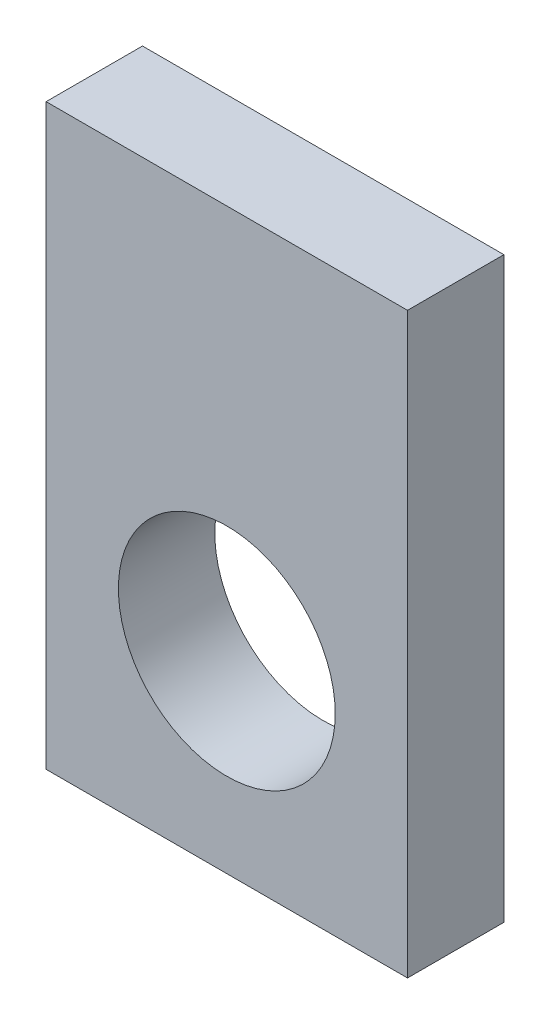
ISO-10303-21;
HEADER;
FILE_DESCRIPTION(('STEP AP214'),'2;1');
FILE_NAME('part.step','',(''),(''),'','','');
FILE_SCHEMA(('AUTOMOTIVE_DESIGN { 1 0 10303 214 1 1 1 1 }'));
ENDSEC;
DATA;
#1=APPLICATION_CONTEXT('core data for automotive mechanical design processes');
#2=APPLICATION_PROTOCOL_DEFINITION('international standard','automotive_design',2000,#1);
#3=PRODUCT_CONTEXT('',#1,'mechanical');
#4=PRODUCT('Part','Part','',(#3));
#5=PRODUCT_RELATED_PRODUCT_CATEGORY('part','',(#4));
#6=PRODUCT_DEFINITION_FORMATION('','',#4);
#7=PRODUCT_DEFINITION_CONTEXT('part definition',#1,'design');
#8=PRODUCT_DEFINITION('design','',#6,#7);
#9=PRODUCT_DEFINITION_SHAPE('','',#8);
#10=(LENGTH_UNIT() NAMED_UNIT(*) SI_UNIT(.MILLI.,.METRE.));
#11=(NAMED_UNIT(*) PLANE_ANGLE_UNIT() SI_UNIT($,.RADIAN.));
#12=(NAMED_UNIT(*) SI_UNIT($,.STERADIAN.) SOLID_ANGLE_UNIT());
#13=UNCERTAINTY_MEASURE_WITH_UNIT(LENGTH_MEASURE(1.E-05),#10,'distance_accuracy_value','');
#14=(GEOMETRIC_REPRESENTATION_CONTEXT(3) GLOBAL_UNCERTAINTY_ASSIGNED_CONTEXT((#13)) GLOBAL_UNIT_ASSIGNED_CONTEXT((#10,
#11,#12)) REPRESENTATION_CONTEXT('',''));
#15=CARTESIAN_POINT('',(0.,0.,0.));
#16=DIRECTION('',(0.,0.,1.));
#17=DIRECTION('',(1.,0.,0.));
#18=AXIS2_PLACEMENT_3D('',#15,#16,#17);
#19=CARTESIAN_POINT('',(0.,24.,4.));
#20=DIRECTION('',(0.,0.,-1.));
#21=DIRECTION('',(-1.,0.,0.));
#22=AXIS2_PLACEMENT_3D('',#19,#20,#21);
#23=PLANE('',#22);
#24=DIRECTION('',(0.,-1.,0.));
#25=VECTOR('',#24,1.);
#26=CARTESIAN_POINT('',(0.,0.,4.));
#27=LINE('',#26,#25);
#28=CARTESIAN_POINT('',(0.,24.,4.));
#29=VERTEX_POINT('',#28);
#30=CARTESIAN_POINT('',(0.,0.,4.));
#31=VERTEX_POINT('',#30);
#32=EDGE_CURVE('E84',#29,#31,#27,.T.);
#33=ORIENTED_EDGE('',*,*,#32,.T.);
#34=DIRECTION('',(1.,0.,0.));
#35=VECTOR('',#34,1.);
#36=CARTESIAN_POINT('',(0.,0.,4.));
#37=LINE('',#36,#35);
#38=CARTESIAN_POINT('',(15.,0.,4.));
#39=VERTEX_POINT('',#38);
#40=EDGE_CURVE('E79',#31,#39,#37,.T.);
#41=ORIENTED_EDGE('',*,*,#40,.T.);
#42=DIRECTION('',(0.,1.,0.));
#43=VECTOR('',#42,1.);
#44=CARTESIAN_POINT('',(15.,0.,4.));
#45=LINE('',#44,#43);
#46=CARTESIAN_POINT('',(15.,24.,4.));
#47=VERTEX_POINT('',#46);
#48=EDGE_CURVE('E82',#39,#47,#45,.T.);
#49=ORIENTED_EDGE('',*,*,#48,.T.);
#50=DIRECTION('',(-1.,0.,0.));
#51=VECTOR('',#50,1.);
#52=CARTESIAN_POINT('',(0.,24.,4.));
#53=LINE('',#52,#51);
#54=EDGE_CURVE('E49',#47,#29,#53,.T.);
#55=ORIENTED_EDGE('',*,*,#54,.T.);
#56=EDGE_LOOP('',(#33,#41,#49,#55));
#57=FACE_BOUND('',#56,.T.);
#58=CARTESIAN_POINT('',(7.5,8.,4.));
#59=DIRECTION('',(0.,0.,1.));
#60=DIRECTION('',(1.,0.,0.));
#61=AXIS2_PLACEMENT_3D('',#58,#59,#60);
#62=CIRCLE('',#61,4.5);
#63=CARTESIAN_POINT('',(12.,8.,4.));
#64=VERTEX_POINT('',#63);
#65=EDGE_CURVE('E99',#64,#64,#62,.T.);
#66=ORIENTED_EDGE('',*,*,#65,.F.);
#67=EDGE_LOOP('',(#66));
#68=FACE_BOUND('',#67,.T.);
#69=ADVANCED_FACE('F32',(#57,#68),#23,.F.);
#70=CARTESIAN_POINT('',(0.,24.,0.));
#71=DIRECTION('',(0.,0.,-1.));
#72=DIRECTION('',(-1.,0.,0.));
#73=AXIS2_PLACEMENT_3D('',#70,#71,#72);
#74=PLANE('',#73);
#75=DIRECTION('',(0.,-1.,0.));
#76=VECTOR('',#75,1.);
#77=CARTESIAN_POINT('',(0.,0.,0.));
#78=LINE('',#77,#76);
#79=CARTESIAN_POINT('',(0.,24.,0.));
#80=VERTEX_POINT('',#79);
#81=CARTESIAN_POINT('',(0.,0.,0.));
#82=VERTEX_POINT('',#81);
#83=EDGE_CURVE('E96',#80,#82,#78,.T.);
#84=ORIENTED_EDGE('',*,*,#83,.F.);
#85=DIRECTION('',(-1.,0.,0.));
#86=VECTOR('',#85,1.);
#87=CARTESIAN_POINT('',(0.,24.,0.));
#88=LINE('',#87,#86);
#89=CARTESIAN_POINT('',(15.,24.,0.));
#90=VERTEX_POINT('',#89);
#91=EDGE_CURVE('E72',#90,#80,#88,.T.);
#92=ORIENTED_EDGE('',*,*,#91,.F.);
#93=DIRECTION('',(0.,1.,0.));
#94=VECTOR('',#93,1.);
#95=CARTESIAN_POINT('',(15.,0.,0.));
#96=LINE('',#95,#94);
#97=CARTESIAN_POINT('',(15.,0.,0.));
#98=VERTEX_POINT('',#97);
#99=EDGE_CURVE('E66',#98,#90,#96,.T.);
#100=ORIENTED_EDGE('',*,*,#99,.F.);
#101=DIRECTION('',(1.,0.,0.));
#102=VECTOR('',#101,1.);
#103=CARTESIAN_POINT('',(0.,0.,0.));
#104=LINE('',#103,#102);
#105=EDGE_CURVE('E88',#82,#98,#104,.T.);
#106=ORIENTED_EDGE('',*,*,#105,.F.);
#107=EDGE_LOOP('',(#84,#92,#100,#106));
#108=FACE_BOUND('',#107,.T.);
#109=CARTESIAN_POINT('',(7.5,8.,0.));
#110=DIRECTION('',(0.,0.,1.));
#111=DIRECTION('',(1.,0.,0.));
#112=AXIS2_PLACEMENT_3D('',#109,#110,#111);
#113=CIRCLE('',#112,4.5);
#114=CARTESIAN_POINT('',(12.,8.,0.));
#115=VERTEX_POINT('',#114);
#116=EDGE_CURVE('E111',#115,#115,#113,.T.);
#117=ORIENTED_EDGE('',*,*,#116,.T.);
#118=EDGE_LOOP('',(#117));
#119=FACE_BOUND('',#118,.T.);
#120=ADVANCED_FACE('F107',(#108,#119),#74,.T.);
#121=CARTESIAN_POINT('',(0.,0.,4.));
#122=DIRECTION('',(1.,0.,0.));
#123=DIRECTION('',(0.,0.,-1.));
#124=AXIS2_PLACEMENT_3D('',#121,#122,#123);
#125=PLANE('',#124);
#126=ORIENTED_EDGE('',*,*,#83,.T.);
#127=DIRECTION('',(0.,0.,-1.));
#128=VECTOR('',#127,1.);
#129=CARTESIAN_POINT('',(0.,0.,4.));
#130=LINE('',#129,#128);
#131=EDGE_CURVE('E11',#31,#82,#130,.T.);
#132=ORIENTED_EDGE('',*,*,#131,.F.);
#133=ORIENTED_EDGE('',*,*,#32,.F.);
#134=DIRECTION('',(0.,0.,-1.));
#135=VECTOR('',#134,1.);
#136=CARTESIAN_POINT('',(0.,24.,4.));
#137=LINE('',#136,#135);
#138=EDGE_CURVE('E92',#29,#80,#137,.T.);
#139=ORIENTED_EDGE('',*,*,#138,.T.);
#140=EDGE_LOOP('',(#126,#132,#133,#139));
#141=FACE_BOUND('',#140,.T.);
#142=ADVANCED_FACE('F34',(#141),#125,.F.);
#143=CARTESIAN_POINT('',(0.,0.,4.));
#144=DIRECTION('',(0.,1.,0.));
#145=DIRECTION('',(0.,0.,1.));
#146=AXIS2_PLACEMENT_3D('',#143,#144,#145);
#147=PLANE('',#146);
#148=ORIENTED_EDGE('',*,*,#105,.T.);
#149=DIRECTION('',(0.,0.,-1.));
#150=VECTOR('',#149,1.);
#151=CARTESIAN_POINT('',(15.,0.,4.));
#152=LINE('',#151,#150);
#153=EDGE_CURVE('E41',#39,#98,#152,.T.);
#154=ORIENTED_EDGE('',*,*,#153,.F.);
#155=ORIENTED_EDGE('',*,*,#40,.F.);
#156=ORIENTED_EDGE('',*,*,#131,.T.);
#157=EDGE_LOOP('',(#148,#154,#155,#156));
#158=FACE_BOUND('',#157,.T.);
#159=ADVANCED_FACE('F87',(#158),#147,.F.);
#160=CARTESIAN_POINT('',(15.,0.,4.));
#161=DIRECTION('',(-1.,0.,0.));
#162=DIRECTION('',(0.,0.,1.));
#163=AXIS2_PLACEMENT_3D('',#160,#161,#162);
#164=PLANE('',#163);
#165=ORIENTED_EDGE('',*,*,#99,.T.);
#166=DIRECTION('',(0.,0.,-1.));
#167=VECTOR('',#166,1.);
#168=CARTESIAN_POINT('',(15.,24.,4.));
#169=LINE('',#168,#167);
#170=EDGE_CURVE('E89',#47,#90,#169,.T.);
#171=ORIENTED_EDGE('',*,*,#170,.F.);
#172=ORIENTED_EDGE('',*,*,#48,.F.);
#173=ORIENTED_EDGE('',*,*,#153,.T.);
#174=EDGE_LOOP('',(#165,#171,#172,#173));
#175=FACE_BOUND('',#174,.T.);
#176=ADVANCED_FACE('F90',(#175),#164,.F.);
#177=CARTESIAN_POINT('',(0.,24.,4.));
#178=DIRECTION('',(0.,-1.,0.));
#179=DIRECTION('',(0.,0.,-1.));
#180=AXIS2_PLACEMENT_3D('',#177,#178,#179);
#181=PLANE('',#180);
#182=ORIENTED_EDGE('',*,*,#91,.T.);
#183=ORIENTED_EDGE('',*,*,#138,.F.);
#184=ORIENTED_EDGE('',*,*,#54,.F.);
#185=ORIENTED_EDGE('',*,*,#170,.T.);
#186=EDGE_LOOP('',(#182,#183,#184,#185));
#187=FACE_BOUND('',#186,.T.);
#188=ADVANCED_FACE('F104',(#187),#181,.F.);
#189=CARTESIAN_POINT('',(7.5,8.,4.));
#190=DIRECTION('',(0.,0.,-1.));
#191=DIRECTION('',(-1.,0.,0.));
#192=AXIS2_PLACEMENT_3D('',#189,#190,#191);
#193=CYLINDRICAL_SURFACE('',#192,4.5);
#194=ORIENTED_EDGE('',*,*,#65,.T.);
#195=EDGE_LOOP('',(#194));
#196=FACE_BOUND('',#195,.T.);
#197=ORIENTED_EDGE('',*,*,#116,.F.);
#198=EDGE_LOOP('',(#197));
#199=FACE_BOUND('',#198,.T.);
#200=ADVANCED_FACE('F117',(#196,#199),#193,.F.);
#201=CLOSED_SHELL('',(#69,#120,#142,#159,#176,#188,#200));
#202=MANIFOLD_SOLID_BREP('B2',#201);
#203=ADVANCED_BREP_SHAPE_REPRESENTATION('',(#18,#202),#14);
#204=SHAPE_DEFINITION_REPRESENTATION(#9,#203);
ENDSEC;
END-ISO-10303-21;
